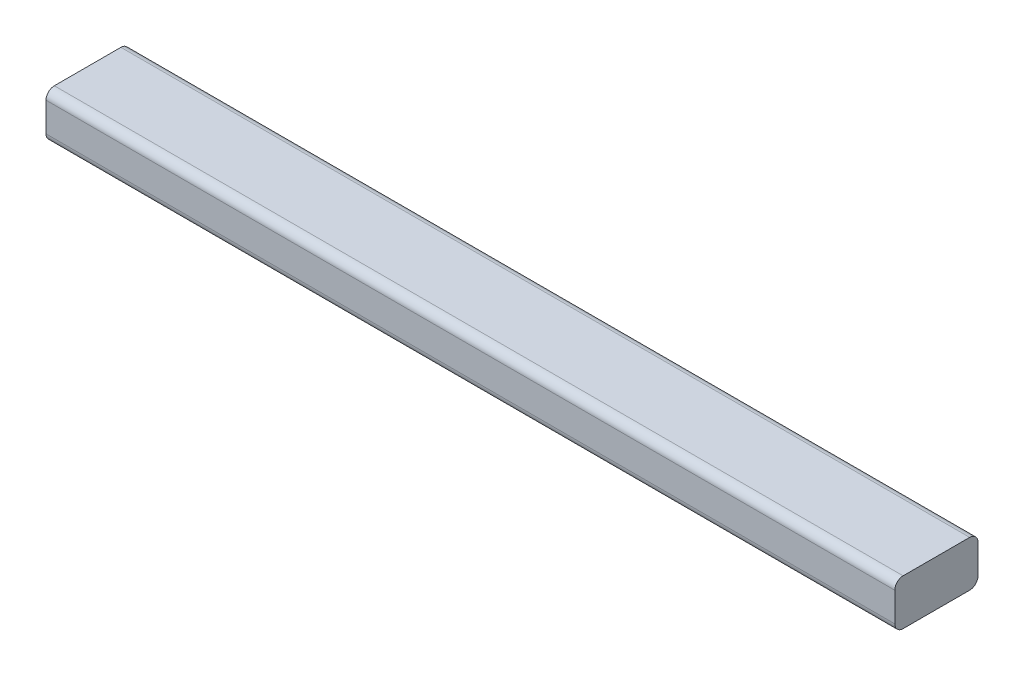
ISO-10303-21;
HEADER;
FILE_DESCRIPTION(('STEP AP214'),'2;1');
FILE_NAME('part.step','',(''),(''),'','','');
FILE_SCHEMA(('AUTOMOTIVE_DESIGN { 1 0 10303 214 1 1 1 1 }'));
ENDSEC;
DATA;
#1=APPLICATION_CONTEXT('core data for automotive mechanical design processes');
#2=APPLICATION_PROTOCOL_DEFINITION('international standard','automotive_design',2000,#1);
#3=PRODUCT_CONTEXT('',#1,'mechanical');
#4=PRODUCT('Part','Part','',(#3));
#5=PRODUCT_RELATED_PRODUCT_CATEGORY('part','',(#4));
#6=PRODUCT_DEFINITION_FORMATION('','',#4);
#7=PRODUCT_DEFINITION_CONTEXT('part definition',#1,'design');
#8=PRODUCT_DEFINITION('design','',#6,#7);
#9=PRODUCT_DEFINITION_SHAPE('','',#8);
#10=(LENGTH_UNIT() NAMED_UNIT(*) SI_UNIT(.MILLI.,.METRE.));
#11=(NAMED_UNIT(*) PLANE_ANGLE_UNIT() SI_UNIT($,.RADIAN.));
#12=(NAMED_UNIT(*) SI_UNIT($,.STERADIAN.) SOLID_ANGLE_UNIT());
#13=UNCERTAINTY_MEASURE_WITH_UNIT(LENGTH_MEASURE(1.E-05),#10,'distance_accuracy_value','');
#14=(GEOMETRIC_REPRESENTATION_CONTEXT(3) GLOBAL_UNCERTAINTY_ASSIGNED_CONTEXT((#13)) GLOBAL_UNIT_ASSIGNED_CONTEXT((#10,
#11,#12)) REPRESENTATION_CONTEXT('',''));
#15=CARTESIAN_POINT('',(0.,0.,0.));
#16=DIRECTION('',(0.,0.,1.));
#17=DIRECTION('',(1.,0.,0.));
#18=AXIS2_PLACEMENT_3D('',#15,#16,#17);
#19=CARTESIAN_POINT('',(720.17072253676,0.,0.));
#20=DIRECTION('',(0.,0.,1.));
#21=DIRECTION('',(1.,0.,0.));
#22=AXIS2_PLACEMENT_3D('',#19,#20,#21);
#23=PLANE('',#22);
#24=DIRECTION('',(0.,1.,0.));
#25=VECTOR('',#24,1.);
#26=CARTESIAN_POINT('',(0.,0.,0.));
#27=LINE('',#26,#25);
#28=CARTESIAN_POINT('',(0.,6.35,0.));
#29=VERTEX_POINT('',#28);
#30=CARTESIAN_POINT('',(0.,28.575,0.));
#31=VERTEX_POINT('',#30);
#32=EDGE_CURVE('E179',#29,#31,#27,.T.);
#33=ORIENTED_EDGE('',*,*,#32,.T.);
#34=DIRECTION('',(-1.,0.,0.));
#35=VECTOR('',#34,1.);
#36=CARTESIAN_POINT('',(720.17072253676,28.575,0.));
#37=LINE('',#36,#35);
#38=CARTESIAN_POINT('',(647.7,28.575,0.));
#39=VERTEX_POINT('',#38);
#40=EDGE_CURVE('E60',#31,#39,#37,.F.);
#41=ORIENTED_EDGE('',*,*,#40,.T.);
#42=DIRECTION('',(0.,1.,0.));
#43=VECTOR('',#42,1.);
#44=CARTESIAN_POINT('',(647.7,0.,0.));
#45=LINE('',#44,#43);
#46=CARTESIAN_POINT('',(647.7,6.35,0.));
#47=VERTEX_POINT('',#46);
#48=EDGE_CURVE('E173',#47,#39,#45,.T.);
#49=ORIENTED_EDGE('',*,*,#48,.F.);
#50=DIRECTION('',(-1.,0.,0.));
#51=VECTOR('',#50,1.);
#52=CARTESIAN_POINT('',(720.17072253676,6.35,0.));
#53=LINE('',#52,#51);
#54=EDGE_CURVE('E121',#47,#29,#53,.T.);
#55=ORIENTED_EDGE('',*,*,#54,.T.);
#56=EDGE_LOOP('',(#33,#41,#49,#55));
#57=FACE_BOUND('',#56,.T.);
#58=ADVANCED_FACE('F45',(#57),#23,.F.);
#59=CARTESIAN_POINT('',(720.17072253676,34.925,0.));
#60=DIRECTION('',(0.,-1.,0.));
#61=DIRECTION('',(0.,0.,-1.));
#62=AXIS2_PLACEMENT_3D('',#59,#60,#61);
#63=PLANE('',#62);
#64=DIRECTION('',(0.,0.,1.));
#65=VECTOR('',#64,1.);
#66=CARTESIAN_POINT('',(0.,34.925,0.));
#67=LINE('',#66,#65);
#68=CARTESIAN_POINT('',(0.,34.925,6.35));
#69=VERTEX_POINT('',#68);
#70=CARTESIAN_POINT('',(0.,34.925,57.15));
#71=VERTEX_POINT('',#70);
#72=EDGE_CURVE('E174',#69,#71,#67,.T.);
#73=ORIENTED_EDGE('',*,*,#72,.T.);
#74=DIRECTION('',(-1.,0.,0.));
#75=VECTOR('',#74,1.);
#76=CARTESIAN_POINT('',(720.17072253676,34.925,57.15));
#77=LINE('',#76,#75);
#78=CARTESIAN_POINT('',(647.7,34.925,57.15));
#79=VERTEX_POINT('',#78);
#80=EDGE_CURVE('E149',#71,#79,#77,.F.);
#81=ORIENTED_EDGE('',*,*,#80,.T.);
#82=DIRECTION('',(0.,0.,1.));
#83=VECTOR('',#82,1.);
#84=CARTESIAN_POINT('',(647.7,34.925,0.));
#85=LINE('',#84,#83);
#86=CARTESIAN_POINT('',(647.7,34.925,6.35));
#87=VERTEX_POINT('',#86);
#88=EDGE_CURVE('E117',#87,#79,#85,.T.);
#89=ORIENTED_EDGE('',*,*,#88,.F.);
#90=DIRECTION('',(-1.,0.,0.));
#91=VECTOR('',#90,1.);
#92=CARTESIAN_POINT('',(720.17072253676,34.925,6.35));
#93=LINE('',#92,#91);
#94=EDGE_CURVE('E146',#87,#69,#93,.T.);
#95=ORIENTED_EDGE('',*,*,#94,.T.);
#96=EDGE_LOOP('',(#73,#81,#89,#95));
#97=FACE_BOUND('',#96,.T.);
#98=ADVANCED_FACE('F189',(#97),#63,.F.);
#99=CARTESIAN_POINT('',(720.17072253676,0.,63.5));
#100=DIRECTION('',(0.,0.,-1.));
#101=DIRECTION('',(-1.,0.,0.));
#102=AXIS2_PLACEMENT_3D('',#99,#100,#101);
#103=PLANE('',#102);
#104=DIRECTION('',(0.,-1.,0.));
#105=VECTOR('',#104,1.);
#106=CARTESIAN_POINT('',(647.7,0.,63.5));
#107=LINE('',#106,#105);
#108=CARTESIAN_POINT('',(647.7,28.575,63.5));
#109=VERTEX_POINT('',#108);
#110=CARTESIAN_POINT('',(647.7,6.34999999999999,63.5));
#111=VERTEX_POINT('',#110);
#112=EDGE_CURVE('E114',#109,#111,#107,.T.);
#113=ORIENTED_EDGE('',*,*,#112,.F.);
#114=DIRECTION('',(-1.,0.,0.));
#115=VECTOR('',#114,1.);
#116=CARTESIAN_POINT('',(720.17072253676,28.575,63.5));
#117=LINE('',#116,#115);
#118=CARTESIAN_POINT('',(0.,28.575,63.5));
#119=VERTEX_POINT('',#118);
#120=EDGE_CURVE('E128',#109,#119,#117,.T.);
#121=ORIENTED_EDGE('',*,*,#120,.T.);
#122=DIRECTION('',(0.,-1.,0.));
#123=VECTOR('',#122,1.);
#124=CARTESIAN_POINT('',(0.,0.,63.5));
#125=LINE('',#124,#123);
#126=CARTESIAN_POINT('',(0.,6.34999999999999,63.5));
#127=VERTEX_POINT('',#126);
#128=EDGE_CURVE('E171',#119,#127,#125,.T.);
#129=ORIENTED_EDGE('',*,*,#128,.T.);
#130=DIRECTION('',(-1.,0.,0.));
#131=VECTOR('',#130,1.);
#132=CARTESIAN_POINT('',(720.17072253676,6.34999999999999,63.5));
#133=LINE('',#132,#131);
#134=EDGE_CURVE('E131',#127,#111,#133,.F.);
#135=ORIENTED_EDGE('',*,*,#134,.T.);
#136=EDGE_LOOP('',(#113,#121,#129,#135));
#137=FACE_BOUND('',#136,.T.);
#138=ADVANCED_FACE('F126',(#137),#103,.F.);
#139=CARTESIAN_POINT('',(720.17072253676,0.,0.));
#140=DIRECTION('',(0.,1.,0.));
#141=DIRECTION('',(0.,0.,1.));
#142=AXIS2_PLACEMENT_3D('',#139,#140,#141);
#143=PLANE('',#142);
#144=DIRECTION('',(0.,0.,-1.));
#145=VECTOR('',#144,1.);
#146=CARTESIAN_POINT('',(0.,0.,0.));
#147=LINE('',#146,#145);
#148=CARTESIAN_POINT('',(0.,0.,57.15));
#149=VERTEX_POINT('',#148);
#150=CARTESIAN_POINT('',(0.,0.,6.35));
#151=VERTEX_POINT('',#150);
#152=EDGE_CURVE('E164',#149,#151,#147,.T.);
#153=ORIENTED_EDGE('',*,*,#152,.T.);
#154=DIRECTION('',(-1.,0.,0.));
#155=VECTOR('',#154,1.);
#156=CARTESIAN_POINT('',(720.17072253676,0.,6.35));
#157=LINE('',#156,#155);
#158=CARTESIAN_POINT('',(647.7,0.,6.35));
#159=VERTEX_POINT('',#158);
#160=EDGE_CURVE('E11',#151,#159,#157,.F.);
#161=ORIENTED_EDGE('',*,*,#160,.T.);
#162=DIRECTION('',(0.,0.,-1.));
#163=VECTOR('',#162,1.);
#164=CARTESIAN_POINT('',(647.7,0.,0.));
#165=LINE('',#164,#163);
#166=CARTESIAN_POINT('',(647.7,0.,57.15));
#167=VERTEX_POINT('',#166);
#168=EDGE_CURVE('E166',#167,#159,#165,.T.);
#169=ORIENTED_EDGE('',*,*,#168,.F.);
#170=DIRECTION('',(-1.,0.,0.));
#171=VECTOR('',#170,1.);
#172=CARTESIAN_POINT('',(720.17072253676,0.,57.15));
#173=LINE('',#172,#171);
#174=EDGE_CURVE('E53',#167,#149,#173,.T.);
#175=ORIENTED_EDGE('',*,*,#174,.T.);
#176=EDGE_LOOP('',(#153,#161,#169,#175));
#177=FACE_BOUND('',#176,.T.);
#178=ADVANCED_FACE('F163',(#177),#143,.F.);
#179=CARTESIAN_POINT('',(0.,0.,0.));
#180=DIRECTION('',(1.,0.,0.));
#181=DIRECTION('',(0.,0.,-1.));
#182=AXIS2_PLACEMENT_3D('',#179,#180,#181);
#183=PLANE('',#182);
#184=ORIENTED_EDGE('',*,*,#128,.F.);
#185=CARTESIAN_POINT('',(0.,28.575,57.15));
#186=DIRECTION('',(1.,0.,0.));
#187=DIRECTION('',(0.,0.,-1.));
#188=AXIS2_PLACEMENT_3D('',#185,#186,#187);
#189=CIRCLE('',#188,6.35);
#190=EDGE_CURVE('E134',#119,#71,#189,.F.);
#191=ORIENTED_EDGE('',*,*,#190,.T.);
#192=ORIENTED_EDGE('',*,*,#72,.F.);
#193=CARTESIAN_POINT('',(0.,28.575,6.35));
#194=DIRECTION('',(1.,0.,0.));
#195=DIRECTION('',(0.,0.,-1.));
#196=AXIS2_PLACEMENT_3D('',#193,#194,#195);
#197=CIRCLE('',#196,6.35);
#198=EDGE_CURVE('E143',#69,#31,#197,.F.);
#199=ORIENTED_EDGE('',*,*,#198,.T.);
#200=ORIENTED_EDGE('',*,*,#32,.F.);
#201=CARTESIAN_POINT('',(0.,6.35,6.35));
#202=DIRECTION('',(1.,0.,0.));
#203=DIRECTION('',(0.,0.,-1.));
#204=AXIS2_PLACEMENT_3D('',#201,#202,#203);
#205=CIRCLE('',#204,6.35);
#206=EDGE_CURVE('E137',#29,#151,#205,.F.);
#207=ORIENTED_EDGE('',*,*,#206,.T.);
#208=ORIENTED_EDGE('',*,*,#152,.F.);
#209=CARTESIAN_POINT('',(0.,6.34999999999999,57.15));
#210=DIRECTION('',(1.,0.,0.));
#211=DIRECTION('',(0.,0.,-1.));
#212=AXIS2_PLACEMENT_3D('',#209,#210,#211);
#213=CIRCLE('',#212,6.35);
#214=EDGE_CURVE('E135',#149,#127,#213,.F.);
#215=ORIENTED_EDGE('',*,*,#214,.T.);
#216=EDGE_LOOP('',(#184,#191,#192,#199,#200,#207,#208,#215));
#217=FACE_BOUND('',#216,.T.);
#218=ADVANCED_FACE('F169',(#217),#183,.F.);
#219=CARTESIAN_POINT('',(647.7,0.,0.));
#220=DIRECTION('',(1.,0.,0.));
#221=DIRECTION('',(0.,0.,-1.));
#222=AXIS2_PLACEMENT_3D('',#219,#220,#221);
#223=PLANE('',#222);
#224=ORIENTED_EDGE('',*,*,#88,.T.);
#225=CARTESIAN_POINT('',(647.7,28.575,57.15));
#226=DIRECTION('',(1.,0.,0.));
#227=DIRECTION('',(0.,0.,-1.));
#228=AXIS2_PLACEMENT_3D('',#225,#226,#227);
#229=CIRCLE('',#228,6.35);
#230=EDGE_CURVE('E111',#79,#109,#229,.T.);
#231=ORIENTED_EDGE('',*,*,#230,.T.);
#232=ORIENTED_EDGE('',*,*,#112,.T.);
#233=CARTESIAN_POINT('',(647.7,6.34999999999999,57.15));
#234=DIRECTION('',(1.,0.,0.));
#235=DIRECTION('',(0.,0.,-1.));
#236=AXIS2_PLACEMENT_3D('',#233,#234,#235);
#237=CIRCLE('',#236,6.35);
#238=EDGE_CURVE('E151',#111,#167,#237,.T.);
#239=ORIENTED_EDGE('',*,*,#238,.T.);
#240=ORIENTED_EDGE('',*,*,#168,.T.);
#241=CARTESIAN_POINT('',(647.7,6.35,6.35));
#242=DIRECTION('',(1.,0.,0.));
#243=DIRECTION('',(0.,0.,-1.));
#244=AXIS2_PLACEMENT_3D('',#241,#242,#243);
#245=CIRCLE('',#244,6.35);
#246=EDGE_CURVE('E67',#159,#47,#245,.T.);
#247=ORIENTED_EDGE('',*,*,#246,.T.);
#248=ORIENTED_EDGE('',*,*,#48,.T.);
#249=CARTESIAN_POINT('',(647.7,28.575,6.35));
#250=DIRECTION('',(1.,0.,0.));
#251=DIRECTION('',(0.,0.,-1.));
#252=AXIS2_PLACEMENT_3D('',#249,#250,#251);
#253=CIRCLE('',#252,6.35);
#254=EDGE_CURVE('E122',#39,#87,#253,.T.);
#255=ORIENTED_EDGE('',*,*,#254,.T.);
#256=EDGE_LOOP('',(#224,#231,#232,#239,#240,#247,#248,#255));
#257=FACE_BOUND('',#256,.T.);
#258=ADVANCED_FACE('F113',(#257),#223,.T.);
#259=CARTESIAN_POINT('',(720.17072253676,28.575,57.15));
#260=DIRECTION('',(-1.,0.,0.));
#261=DIRECTION('',(0.,0.,1.));
#262=AXIS2_PLACEMENT_3D('',#259,#260,#261);
#263=CYLINDRICAL_SURFACE('',#262,6.35);
#264=ORIENTED_EDGE('',*,*,#230,.F.);
#265=ORIENTED_EDGE('',*,*,#80,.F.);
#266=ORIENTED_EDGE('',*,*,#190,.F.);
#267=ORIENTED_EDGE('',*,*,#120,.F.);
#268=EDGE_LOOP('',(#264,#265,#266,#267));
#269=FACE_BOUND('',#268,.T.);
#270=ADVANCED_FACE('F133',(#269),#263,.T.);
#271=CARTESIAN_POINT('',(720.17072253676,28.575,6.35));
#272=DIRECTION('',(-1.,0.,0.));
#273=DIRECTION('',(0.,0.,1.));
#274=AXIS2_PLACEMENT_3D('',#271,#272,#273);
#275=CYLINDRICAL_SURFACE('',#274,6.35);
#276=ORIENTED_EDGE('',*,*,#254,.F.);
#277=ORIENTED_EDGE('',*,*,#40,.F.);
#278=ORIENTED_EDGE('',*,*,#198,.F.);
#279=ORIENTED_EDGE('',*,*,#94,.F.);
#280=EDGE_LOOP('',(#276,#277,#278,#279));
#281=FACE_BOUND('',#280,.T.);
#282=ADVANCED_FACE('F186',(#281),#275,.T.);
#283=CARTESIAN_POINT('',(720.17072253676,6.35,6.35));
#284=DIRECTION('',(-1.,0.,0.));
#285=DIRECTION('',(0.,0.,1.));
#286=AXIS2_PLACEMENT_3D('',#283,#284,#285);
#287=CYLINDRICAL_SURFACE('',#286,6.35);
#288=ORIENTED_EDGE('',*,*,#246,.F.);
#289=ORIENTED_EDGE('',*,*,#160,.F.);
#290=ORIENTED_EDGE('',*,*,#206,.F.);
#291=ORIENTED_EDGE('',*,*,#54,.F.);
#292=EDGE_LOOP('',(#288,#289,#290,#291));
#293=FACE_BOUND('',#292,.T.);
#294=ADVANCED_FACE('F191',(#293),#287,.T.);
#295=CARTESIAN_POINT('',(720.17072253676,6.34999999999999,57.15));
#296=DIRECTION('',(-1.,0.,0.));
#297=DIRECTION('',(0.,0.,1.));
#298=AXIS2_PLACEMENT_3D('',#295,#296,#297);
#299=CYLINDRICAL_SURFACE('',#298,6.35);
#300=ORIENTED_EDGE('',*,*,#238,.F.);
#301=ORIENTED_EDGE('',*,*,#134,.F.);
#302=ORIENTED_EDGE('',*,*,#214,.F.);
#303=ORIENTED_EDGE('',*,*,#174,.F.);
#304=EDGE_LOOP('',(#300,#301,#302,#303));
#305=FACE_BOUND('',#304,.T.);
#306=ADVANCED_FACE('F47',(#305),#299,.T.);
#307=CLOSED_SHELL('',(#58,#98,#138,#178,#218,#258,#270,#282,#294,#306));
#308=MANIFOLD_SOLID_BREP('B2',#307);
#309=ADVANCED_BREP_SHAPE_REPRESENTATION('',(#18,#308),#14);
#310=SHAPE_DEFINITION_REPRESENTATION(#9,#309);
ENDSEC;
END-ISO-10303-21;
